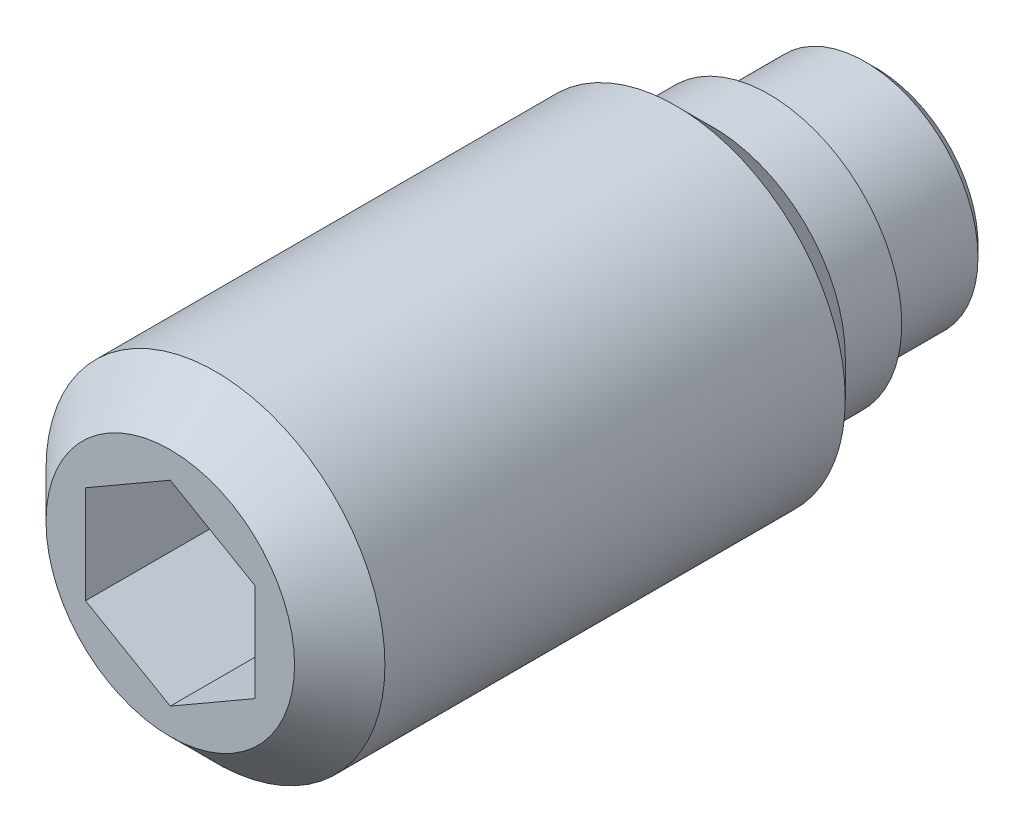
ISO-10303-21;
HEADER;
FILE_DESCRIPTION(('STEP AP214'),'2;1');
FILE_NAME('part.step','',(''),(''),'','','');
FILE_SCHEMA(('AUTOMOTIVE_DESIGN { 1 0 10303 214 1 1 1 1 }'));
ENDSEC;
DATA;
#1=APPLICATION_CONTEXT('core data for automotive mechanical design processes');
#2=APPLICATION_PROTOCOL_DEFINITION('international standard','automotive_design',2000,#1);
#3=PRODUCT_CONTEXT('',#1,'mechanical');
#4=PRODUCT('Part','Part','',(#3));
#5=PRODUCT_RELATED_PRODUCT_CATEGORY('part','',(#4));
#6=PRODUCT_DEFINITION_FORMATION('','',#4);
#7=PRODUCT_DEFINITION_CONTEXT('part definition',#1,'design');
#8=PRODUCT_DEFINITION('design','',#6,#7);
#9=PRODUCT_DEFINITION_SHAPE('','',#8);
#10=(LENGTH_UNIT() NAMED_UNIT(*) SI_UNIT(.MILLI.,.METRE.));
#11=(NAMED_UNIT(*) PLANE_ANGLE_UNIT() SI_UNIT($,.RADIAN.));
#12=(NAMED_UNIT(*) SI_UNIT($,.STERADIAN.) SOLID_ANGLE_UNIT());
#13=UNCERTAINTY_MEASURE_WITH_UNIT(LENGTH_MEASURE(1.E-05),#10,'distance_accuracy_value','');
#14=(GEOMETRIC_REPRESENTATION_CONTEXT(3) GLOBAL_UNCERTAINTY_ASSIGNED_CONTEXT((#13)) GLOBAL_UNIT_ASSIGNED_CONTEXT((#10,
#11,#12)) REPRESENTATION_CONTEXT('',''));
#15=CARTESIAN_POINT('',(0.,0.,0.));
#16=DIRECTION('',(0.,0.,1.));
#17=DIRECTION('',(1.,0.,0.));
#18=AXIS2_PLACEMENT_3D('',#15,#16,#17);
#19=CARTESIAN_POINT('',(0.,0.,1.9));
#20=DIRECTION('',(0.,0.,-1.));
#21=DIRECTION('',(-1.,0.,0.));
#22=AXIS2_PLACEMENT_3D('',#19,#20,#21);
#23=CYLINDRICAL_SURFACE('',#22,3.);
#24=CARTESIAN_POINT('',(0.,0.,11.7));
#25=DIRECTION('',(0.,0.,1.));
#26=DIRECTION('',(1.,0.,0.));
#27=AXIS2_PLACEMENT_3D('',#24,#25,#26);
#28=CIRCLE('',#27,3.);
#29=CARTESIAN_POINT('',(3.,0.,11.7));
#30=VERTEX_POINT('',#29);
#31=EDGE_CURVE('E9',#30,#30,#28,.F.);
#32=ORIENTED_EDGE('',*,*,#31,.T.);
#33=EDGE_LOOP('',(#32));
#34=FACE_BOUND('',#33,.T.);
#35=CARTESIAN_POINT('',(0.,0.,3.55));
#36=DIRECTION('',(0.,0.,-1.));
#37=DIRECTION('',(-1.,0.,0.));
#38=AXIS2_PLACEMENT_3D('',#35,#36,#37);
#39=CIRCLE('',#38,3.);
#40=CARTESIAN_POINT('',(-3.,0.,3.55));
#41=VERTEX_POINT('',#40);
#42=EDGE_CURVE('E74',#41,#41,#39,.T.);
#43=ORIENTED_EDGE('',*,*,#42,.F.);
#44=EDGE_LOOP('',(#43));
#45=FACE_BOUND('',#44,.T.);
#46=ADVANCED_FACE('F14',(#34,#45),#23,.T.);
#47=CARTESIAN_POINT('',(0.,0.,3.55));
#48=DIRECTION('',(0.,0.,1.));
#49=DIRECTION('',(1.,0.,0.));
#50=AXIS2_PLACEMENT_3D('',#47,#48,#49);
#51=CONICAL_SURFACE('',#50,3.,0.785398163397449);
#52=ORIENTED_EDGE('',*,*,#42,.T.);
#53=EDGE_LOOP('',(#52));
#54=FACE_BOUND('',#53,.T.);
#55=CARTESIAN_POINT('',(0.,0.,2.9));
#56=DIRECTION('',(0.,0.,-1.));
#57=DIRECTION('',(-1.,0.,0.));
#58=AXIS2_PLACEMENT_3D('',#55,#56,#57);
#59=CIRCLE('',#58,2.35);
#60=CARTESIAN_POINT('',(-2.35,0.,2.9));
#61=VERTEX_POINT('',#60);
#62=EDGE_CURVE('E112',#61,#61,#59,.T.);
#63=ORIENTED_EDGE('',*,*,#62,.F.);
#64=EDGE_LOOP('',(#63));
#65=FACE_BOUND('',#64,.T.);
#66=ADVANCED_FACE('F130',(#54,#65),#51,.T.);
#67=CARTESIAN_POINT('',(0.,0.,1.9));
#68=DIRECTION('',(0.,0.,-1.));
#69=DIRECTION('',(-1.,0.,0.));
#70=AXIS2_PLACEMENT_3D('',#67,#68,#69);
#71=CYLINDRICAL_SURFACE('',#70,2.35);
#72=ORIENTED_EDGE('',*,*,#62,.T.);
#73=EDGE_LOOP('',(#72));
#74=FACE_BOUND('',#73,.T.);
#75=CARTESIAN_POINT('',(0.,0.,1.9));
#76=DIRECTION('',(0.,0.,-1.));
#77=DIRECTION('',(-1.,0.,0.));
#78=AXIS2_PLACEMENT_3D('',#75,#76,#77);
#79=CIRCLE('',#78,2.35);
#80=CARTESIAN_POINT('',(-2.35,0.,1.9));
#81=VERTEX_POINT('',#80);
#82=EDGE_CURVE('E109',#81,#81,#79,.T.);
#83=ORIENTED_EDGE('',*,*,#82,.F.);
#84=EDGE_LOOP('',(#83));
#85=FACE_BOUND('',#84,.T.);
#86=ADVANCED_FACE('F135',(#74,#85),#71,.T.);
#87=CARTESIAN_POINT('',(0.,2.35,1.9));
#88=DIRECTION('',(0.,0.,1.));
#89=DIRECTION('',(1.,0.,0.));
#90=AXIS2_PLACEMENT_3D('',#87,#88,#89);
#91=PLANE('',#90);
#92=ORIENTED_EDGE('',*,*,#82,.T.);
#93=EDGE_LOOP('',(#92));
#94=FACE_BOUND('',#93,.T.);
#95=CARTESIAN_POINT('',(0.,0.,1.9));
#96=DIRECTION('',(0.,0.,-1.));
#97=DIRECTION('',(-1.,0.,0.));
#98=AXIS2_PLACEMENT_3D('',#95,#96,#97);
#99=CIRCLE('',#98,2.);
#100=CARTESIAN_POINT('',(-2.,0.,1.9));
#101=VERTEX_POINT('',#100);
#102=EDGE_CURVE('E106',#101,#101,#99,.T.);
#103=ORIENTED_EDGE('',*,*,#102,.F.);
#104=EDGE_LOOP('',(#103));
#105=FACE_BOUND('',#104,.T.);
#106=ADVANCED_FACE('F142',(#94,#105),#91,.F.);
#107=CARTESIAN_POINT('',(0.,0.,0.));
#108=DIRECTION('',(0.,0.,-1.));
#109=DIRECTION('',(-1.,0.,0.));
#110=AXIS2_PLACEMENT_3D('',#107,#108,#109);
#111=CYLINDRICAL_SURFACE('',#110,2.);
#112=CARTESIAN_POINT('',(0.,0.,0.2));
#113=DIRECTION('',(0.,0.,-1.));
#114=DIRECTION('',(-1.,0.,0.));
#115=AXIS2_PLACEMENT_3D('',#112,#113,#114);
#116=CIRCLE('',#115,2.);
#117=CARTESIAN_POINT('',(-2.,0.,0.2));
#118=VERTEX_POINT('',#117);
#119=EDGE_CURVE('E103',#118,#118,#116,.T.);
#120=ORIENTED_EDGE('',*,*,#119,.F.);
#121=EDGE_LOOP('',(#120));
#122=FACE_BOUND('',#121,.T.);
#123=ORIENTED_EDGE('',*,*,#102,.T.);
#124=EDGE_LOOP('',(#123));
#125=FACE_BOUND('',#124,.T.);
#126=ADVANCED_FACE('F146',(#122,#125),#111,.T.);
#127=CARTESIAN_POINT('',(0.,0.,0.2));
#128=DIRECTION('',(0.,0.,1.));
#129=DIRECTION('',(1.,0.,0.));
#130=AXIS2_PLACEMENT_3D('',#127,#128,#129);
#131=CONICAL_SURFACE('',#130,2.,0.785398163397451);
#132=CARTESIAN_POINT('',(0.,0.,0.));
#133=DIRECTION('',(0.,0.,-1.));
#134=DIRECTION('',(-1.,0.,0.));
#135=AXIS2_PLACEMENT_3D('',#132,#133,#134);
#136=CIRCLE('',#135,1.8);
#137=CARTESIAN_POINT('',(-1.8,0.,0.));
#138=VERTEX_POINT('',#137);
#139=EDGE_CURVE('E100',#138,#138,#136,.T.);
#140=ORIENTED_EDGE('',*,*,#139,.F.);
#141=EDGE_LOOP('',(#140));
#142=FACE_BOUND('',#141,.T.);
#143=ORIENTED_EDGE('',*,*,#119,.T.);
#144=EDGE_LOOP('',(#143));
#145=FACE_BOUND('',#144,.T.);
#146=ADVANCED_FACE('F150',(#142,#145),#131,.T.);
#147=CARTESIAN_POINT('',(0.,1.8,0.));
#148=DIRECTION('',(0.,0.,1.));
#149=DIRECTION('',(1.,0.,0.));
#150=AXIS2_PLACEMENT_3D('',#147,#148,#149);
#151=PLANE('',#150);
#152=ORIENTED_EDGE('',*,*,#139,.T.);
#153=EDGE_LOOP('',(#152));
#154=FACE_BOUND('',#153,.T.);
#155=ADVANCED_FACE('F154',(#154),#151,.F.);
#156=CARTESIAN_POINT('',(0.,0.,12.5));
#157=DIRECTION('',(0.,0.,1.));
#158=DIRECTION('',(1.,0.,0.));
#159=AXIS2_PLACEMENT_3D('',#156,#157,#158);
#160=PLANE('',#159);
#161=CARTESIAN_POINT('',(0.,0.,12.5));
#162=DIRECTION('',(0.,0.,1.));
#163=DIRECTION('',(1.,0.,0.));
#164=AXIS2_PLACEMENT_3D('',#161,#162,#163);
#165=CIRCLE('',#164,2.2);
#166=CARTESIAN_POINT('',(2.2,0.,12.5));
#167=VERTEX_POINT('',#166);
#168=EDGE_CURVE('E22',#167,#167,#165,.T.);
#169=ORIENTED_EDGE('',*,*,#168,.T.);
#170=EDGE_LOOP('',(#169));
#171=FACE_BOUND('',#170,.T.);
#172=DIRECTION('',(-0.866025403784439,0.5,0.));
#173=VECTOR('',#172,1.);
#174=CARTESIAN_POINT('',(-1.5,-0.866025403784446,12.5));
#175=LINE('',#174,#173);
#176=CARTESIAN_POINT('',(0.,-1.73205080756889,12.5));
#177=VERTEX_POINT('',#176);
#178=CARTESIAN_POINT('',(-1.5,-0.866025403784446,12.5));
#179=VERTEX_POINT('',#178);
#180=EDGE_CURVE('E69',#177,#179,#175,.T.);
#181=ORIENTED_EDGE('',*,*,#180,.T.);
#182=DIRECTION('',(0.,1.,0.));
#183=VECTOR('',#182,1.);
#184=CARTESIAN_POINT('',(-1.5,0.866025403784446,12.5));
#185=LINE('',#184,#183);
#186=CARTESIAN_POINT('',(-1.5,0.866025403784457,12.5));
#187=VERTEX_POINT('',#186);
#188=EDGE_CURVE('E84',#179,#187,#185,.T.);
#189=ORIENTED_EDGE('',*,*,#188,.T.);
#190=DIRECTION('',(0.866025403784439,0.5,0.));
#191=VECTOR('',#190,1.);
#192=CARTESIAN_POINT('',(0.,1.73205080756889,12.5));
#193=LINE('',#192,#191);
#194=CARTESIAN_POINT('',(0.,1.73205080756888,12.5));
#195=VERTEX_POINT('',#194);
#196=EDGE_CURVE('E301',#187,#195,#193,.T.);
#197=ORIENTED_EDGE('',*,*,#196,.T.);
#198=DIRECTION('',(0.866025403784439,-0.5,0.));
#199=VECTOR('',#198,1.);
#200=CARTESIAN_POINT('',(1.5,0.866025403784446,12.5));
#201=LINE('',#200,#199);
#202=CARTESIAN_POINT('',(1.5,0.866025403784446,12.5));
#203=VERTEX_POINT('',#202);
#204=EDGE_CURVE('E298',#195,#203,#201,.T.);
#205=ORIENTED_EDGE('',*,*,#204,.T.);
#206=DIRECTION('',(0.,-1.,0.));
#207=VECTOR('',#206,1.);
#208=CARTESIAN_POINT('',(1.5,-0.866025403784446,12.5));
#209=LINE('',#208,#207);
#210=CARTESIAN_POINT('',(1.5,-0.866025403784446,12.5));
#211=VERTEX_POINT('',#210);
#212=EDGE_CURVE('E29',#203,#211,#209,.T.);
#213=ORIENTED_EDGE('',*,*,#212,.T.);
#214=DIRECTION('',(-0.866025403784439,-0.5,0.));
#215=VECTOR('',#214,1.);
#216=CARTESIAN_POINT('',(0.,-1.73205080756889,12.5));
#217=LINE('',#216,#215);
#218=EDGE_CURVE('E66',#211,#177,#217,.T.);
#219=ORIENTED_EDGE('',*,*,#218,.T.);
#220=EDGE_LOOP('',(#181,#189,#197,#205,#213,#219));
#221=FACE_BOUND('',#220,.T.);
#222=ADVANCED_FACE('F68',(#171,#221),#160,.T.);
#223=CARTESIAN_POINT('',(0.,0.,9.));
#224=DIRECTION('',(0.,0.,1.));
#225=DIRECTION('',(1.,0.,0.));
#226=AXIS2_PLACEMENT_3D('',#223,#224,#225);
#227=PLANE('',#226);
#228=DIRECTION('',(0.,-1.,0.));
#229=VECTOR('',#228,1.);
#230=CARTESIAN_POINT('',(-1.5,0.866025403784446,9.));
#231=LINE('',#230,#229);
#232=CARTESIAN_POINT('',(-1.5,0.866025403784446,9.));
#233=VERTEX_POINT('',#232);
#234=CARTESIAN_POINT('',(-1.5,-0.866025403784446,9.));
#235=VERTEX_POINT('',#234);
#236=EDGE_CURVE('E83',#233,#235,#231,.T.);
#237=ORIENTED_EDGE('',*,*,#236,.T.);
#238=DIRECTION('',(0.866025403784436,-0.5,0.));
#239=VECTOR('',#238,1.);
#240=CARTESIAN_POINT('',(-1.5,-0.866025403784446,9.));
#241=LINE('',#240,#239);
#242=CARTESIAN_POINT('',(0.,-1.73205080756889,9.));
#243=VERTEX_POINT('',#242);
#244=EDGE_CURVE('E280',#235,#243,#241,.T.);
#245=ORIENTED_EDGE('',*,*,#244,.T.);
#246=DIRECTION('',(0.866025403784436,0.5,0.));
#247=VECTOR('',#246,1.);
#248=CARTESIAN_POINT('',(0.,-1.73205080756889,9.));
#249=LINE('',#248,#247);
#250=CARTESIAN_POINT('',(1.5,-0.866025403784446,9.));
#251=VERTEX_POINT('',#250);
#252=EDGE_CURVE('E88',#243,#251,#249,.T.);
#253=ORIENTED_EDGE('',*,*,#252,.T.);
#254=DIRECTION('',(0.,1.,0.));
#255=VECTOR('',#254,1.);
#256=CARTESIAN_POINT('',(1.5,-0.866025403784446,9.));
#257=LINE('',#256,#255);
#258=CARTESIAN_POINT('',(1.5,0.866025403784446,9.));
#259=VERTEX_POINT('',#258);
#260=EDGE_CURVE('E287',#251,#259,#257,.T.);
#261=ORIENTED_EDGE('',*,*,#260,.T.);
#262=DIRECTION('',(-0.866025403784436,0.5,0.));
#263=VECTOR('',#262,1.);
#264=CARTESIAN_POINT('',(1.5,0.866025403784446,9.));
#265=LINE('',#264,#263);
#266=CARTESIAN_POINT('',(0.,1.73205080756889,9.));
#267=VERTEX_POINT('',#266);
#268=EDGE_CURVE('E96',#259,#267,#265,.T.);
#269=ORIENTED_EDGE('',*,*,#268,.T.);
#270=DIRECTION('',(-0.866025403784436,-0.5,0.));
#271=VECTOR('',#270,1.);
#272=CARTESIAN_POINT('',(0.,1.73205080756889,9.));
#273=LINE('',#272,#271);
#274=EDGE_CURVE('E91',#267,#233,#273,.T.);
#275=ORIENTED_EDGE('',*,*,#274,.T.);
#276=EDGE_LOOP('',(#237,#245,#253,#261,#269,#275));
#277=FACE_BOUND('',#276,.T.);
#278=ADVANCED_FACE('F162',(#277),#227,.T.);
#279=CARTESIAN_POINT('',(0.,-1.73205080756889,14.));
#280=DIRECTION('',(0.5,-0.866025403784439,0.));
#281=DIRECTION('',(0.866025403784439,0.5,0.));
#282=AXIS2_PLACEMENT_3D('',#279,#280,#281);
#283=PLANE('',#282);
#284=ORIENTED_EDGE('',*,*,#218,.F.);
#285=DIRECTION('',(0.,0.,1.));
#286=VECTOR('',#285,1.);
#287=CARTESIAN_POINT('',(1.5,-0.866025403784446,14.));
#288=LINE('',#287,#286);
#289=EDGE_CURVE('E90',#251,#211,#288,.T.);
#290=ORIENTED_EDGE('',*,*,#289,.F.);
#291=ORIENTED_EDGE('',*,*,#252,.F.);
#292=DIRECTION('',(0.,0.,1.));
#293=VECTOR('',#292,1.);
#294=CARTESIAN_POINT('',(0.,-1.73205080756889,14.));
#295=LINE('',#294,#293);
#296=EDGE_CURVE('E80',#243,#177,#295,.T.);
#297=ORIENTED_EDGE('',*,*,#296,.T.);
#298=EDGE_LOOP('',(#284,#290,#291,#297));
#299=FACE_BOUND('',#298,.T.);
#300=ADVANCED_FACE('F86',(#299),#283,.F.);
#301=CARTESIAN_POINT('',(1.5,-0.866025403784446,14.));
#302=DIRECTION('',(1.,0.,0.));
#303=DIRECTION('',(0.,0.,-1.));
#304=AXIS2_PLACEMENT_3D('',#301,#302,#303);
#305=PLANE('',#304);
#306=ORIENTED_EDGE('',*,*,#212,.F.);
#307=DIRECTION('',(0.,0.,1.));
#308=VECTOR('',#307,1.);
#309=CARTESIAN_POINT('',(1.5,0.866025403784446,14.));
#310=LINE('',#309,#308);
#311=EDGE_CURVE('E93',#259,#203,#310,.T.);
#312=ORIENTED_EDGE('',*,*,#311,.F.);
#313=ORIENTED_EDGE('',*,*,#260,.F.);
#314=ORIENTED_EDGE('',*,*,#289,.T.);
#315=EDGE_LOOP('',(#306,#312,#313,#314));
#316=FACE_BOUND('',#315,.T.);
#317=ADVANCED_FACE('F161',(#316),#305,.F.);
#318=CARTESIAN_POINT('',(1.5,0.866025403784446,14.));
#319=DIRECTION('',(0.5,0.866025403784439,0.));
#320=DIRECTION('',(-0.866025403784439,0.5,0.));
#321=AXIS2_PLACEMENT_3D('',#318,#319,#320);
#322=PLANE('',#321);
#323=ORIENTED_EDGE('',*,*,#204,.F.);
#324=DIRECTION('',(0.,0.,1.));
#325=VECTOR('',#324,1.);
#326=CARTESIAN_POINT('',(0.,1.73205080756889,14.));
#327=LINE('',#326,#325);
#328=EDGE_CURVE('E293',#267,#195,#327,.T.);
#329=ORIENTED_EDGE('',*,*,#328,.F.);
#330=ORIENTED_EDGE('',*,*,#268,.F.);
#331=ORIENTED_EDGE('',*,*,#311,.T.);
#332=EDGE_LOOP('',(#323,#329,#330,#331));
#333=FACE_BOUND('',#332,.T.);
#334=ADVANCED_FACE('F165',(#333),#322,.F.);
#335=CARTESIAN_POINT('',(0.,1.73205080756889,14.));
#336=DIRECTION('',(-0.5,0.866025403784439,0.));
#337=DIRECTION('',(-0.866025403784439,-0.5,0.));
#338=AXIS2_PLACEMENT_3D('',#335,#336,#337);
#339=PLANE('',#338);
#340=ORIENTED_EDGE('',*,*,#196,.F.);
#341=DIRECTION('',(0.,0.,1.));
#342=VECTOR('',#341,1.);
#343=CARTESIAN_POINT('',(-1.5,0.866025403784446,14.));
#344=LINE('',#343,#342);
#345=EDGE_CURVE('E37',#233,#187,#344,.T.);
#346=ORIENTED_EDGE('',*,*,#345,.F.);
#347=ORIENTED_EDGE('',*,*,#274,.F.);
#348=ORIENTED_EDGE('',*,*,#328,.T.);
#349=EDGE_LOOP('',(#340,#346,#347,#348));
#350=FACE_BOUND('',#349,.T.);
#351=ADVANCED_FACE('F169',(#350),#339,.F.);
#352=CARTESIAN_POINT('',(-1.5,0.866025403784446,14.));
#353=DIRECTION('',(-1.,0.,0.));
#354=DIRECTION('',(0.,0.,1.));
#355=AXIS2_PLACEMENT_3D('',#352,#353,#354);
#356=PLANE('',#355);
#357=ORIENTED_EDGE('',*,*,#188,.F.);
#358=DIRECTION('',(0.,0.,1.));
#359=VECTOR('',#358,1.);
#360=CARTESIAN_POINT('',(-1.5,-0.866025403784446,14.));
#361=LINE('',#360,#359);
#362=EDGE_CURVE('E82',#235,#179,#361,.T.);
#363=ORIENTED_EDGE('',*,*,#362,.F.);
#364=ORIENTED_EDGE('',*,*,#236,.F.);
#365=ORIENTED_EDGE('',*,*,#345,.T.);
#366=EDGE_LOOP('',(#357,#363,#364,#365));
#367=FACE_BOUND('',#366,.T.);
#368=ADVANCED_FACE('F126',(#367),#356,.F.);
#369=CARTESIAN_POINT('',(-1.5,-0.866025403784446,14.));
#370=DIRECTION('',(-0.5,-0.866025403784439,0.));
#371=DIRECTION('',(0.866025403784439,-0.5,0.));
#372=AXIS2_PLACEMENT_3D('',#369,#370,#371);
#373=PLANE('',#372);
#374=ORIENTED_EDGE('',*,*,#180,.F.);
#375=ORIENTED_EDGE('',*,*,#296,.F.);
#376=ORIENTED_EDGE('',*,*,#244,.F.);
#377=ORIENTED_EDGE('',*,*,#362,.T.);
#378=EDGE_LOOP('',(#374,#375,#376,#377));
#379=FACE_BOUND('',#378,.T.);
#380=ADVANCED_FACE('F78',(#379),#373,.F.);
#381=CARTESIAN_POINT('',(0.,0.,12.5));
#382=DIRECTION('',(0.,0.,-1.));
#383=DIRECTION('',(-1.,0.,0.));
#384=AXIS2_PLACEMENT_3D('',#381,#382,#383);
#385=CONICAL_SURFACE('',#384,2.2,0.785398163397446);
#386=ORIENTED_EDGE('',*,*,#31,.F.);
#387=EDGE_LOOP('',(#386));
#388=FACE_BOUND('',#387,.T.);
#389=ORIENTED_EDGE('',*,*,#168,.F.);
#390=EDGE_LOOP('',(#389));
#391=FACE_BOUND('',#390,.T.);
#392=ADVANCED_FACE('F16',(#388,#391),#385,.T.);
#393=CLOSED_SHELL('',(#46,#66,#86,#106,#126,#146,#155,#222,#278,#300,#317,#334,#351,#368,#380,#392));
#394=MANIFOLD_SOLID_BREP('B1',#393);
#395=ADVANCED_BREP_SHAPE_REPRESENTATION('',(#18,#394),#14);
#396=SHAPE_DEFINITION_REPRESENTATION(#9,#395);
ENDSEC;
END-ISO-10303-21;
